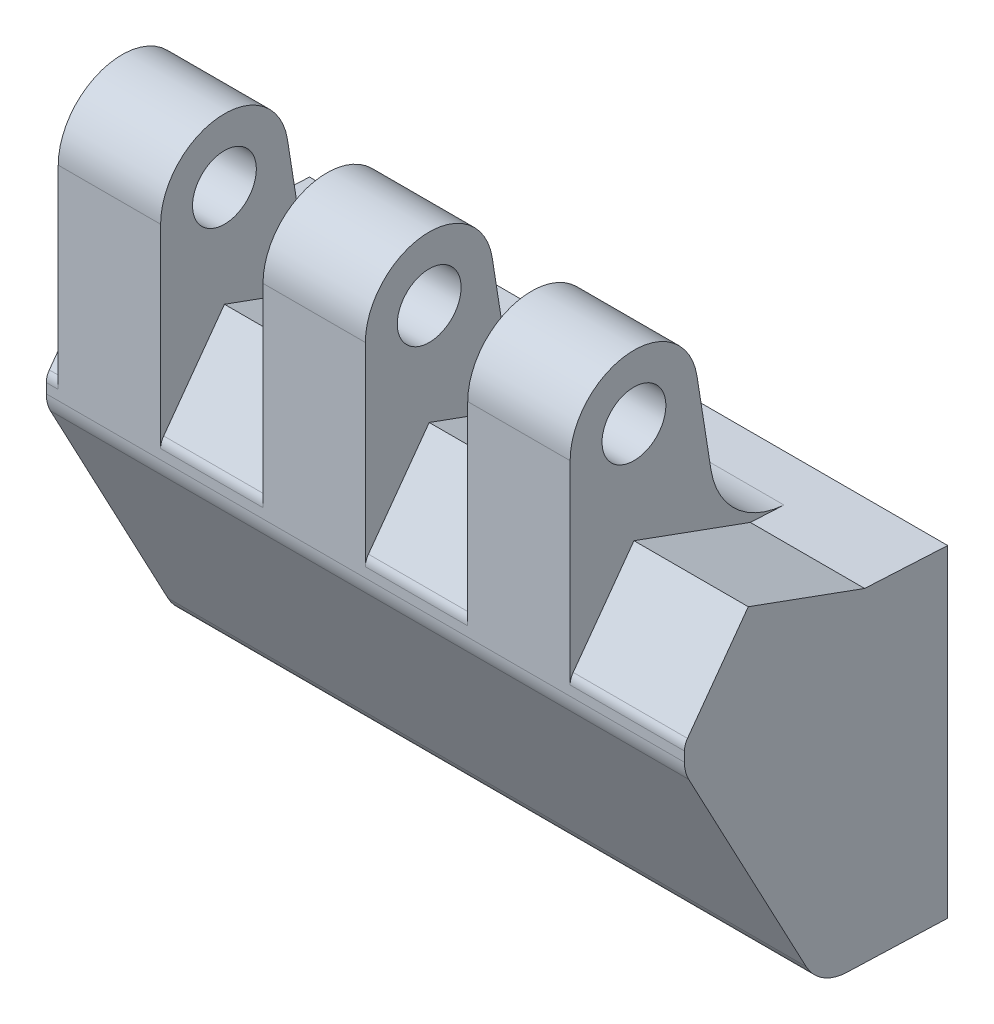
ISO-10303-21;
HEADER;
FILE_DESCRIPTION(('STEP AP214'),'2;1');
FILE_NAME('part.step','',(''),(''),'','','');
FILE_SCHEMA(('AUTOMOTIVE_DESIGN { 1 0 10303 214 1 1 1 1 }'));
ENDSEC;
DATA;
#1=APPLICATION_CONTEXT('core data for automotive mechanical design processes');
#2=APPLICATION_PROTOCOL_DEFINITION('international standard','automotive_design',2000,#1);
#3=PRODUCT_CONTEXT('',#1,'mechanical');
#4=PRODUCT('Part','Part','',(#3));
#5=PRODUCT_RELATED_PRODUCT_CATEGORY('part','',(#4));
#6=PRODUCT_DEFINITION_FORMATION('','',#4);
#7=PRODUCT_DEFINITION_CONTEXT('part definition',#1,'design');
#8=PRODUCT_DEFINITION('design','',#6,#7);
#9=PRODUCT_DEFINITION_SHAPE('','',#8);
#10=(LENGTH_UNIT() NAMED_UNIT(*) SI_UNIT(.MILLI.,.METRE.));
#11=(NAMED_UNIT(*) PLANE_ANGLE_UNIT() SI_UNIT($,.RADIAN.));
#12=(NAMED_UNIT(*) SI_UNIT($,.STERADIAN.) SOLID_ANGLE_UNIT());
#13=UNCERTAINTY_MEASURE_WITH_UNIT(LENGTH_MEASURE(1.E-05),#10,'distance_accuracy_value','');
#14=(GEOMETRIC_REPRESENTATION_CONTEXT(3) GLOBAL_UNCERTAINTY_ASSIGNED_CONTEXT((#13)) GLOBAL_UNIT_ASSIGNED_CONTEXT((#10,
#11,#12)) REPRESENTATION_CONTEXT('',''));
#15=CARTESIAN_POINT('',(0.,0.,0.));
#16=DIRECTION('',(0.,0.,1.));
#17=DIRECTION('',(1.,0.,0.));
#18=AXIS2_PLACEMENT_3D('',#15,#16,#17);
#19=CARTESIAN_POINT('',(30.25,10.93,0.));
#20=DIRECTION('',(0.,0.998629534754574,-0.0523359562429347));
#21=DIRECTION('',(0.,0.0523359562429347,0.998629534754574));
#22=AXIS2_PLACEMENT_3D('',#19,#20,#21);
#23=PLANE('',#22);
#24=DIRECTION('',(-1.,0.,0.));
#25=VECTOR('',#24,1.);
#26=CARTESIAN_POINT('',(30.25,10.93,0.));
#27=LINE('',#26,#25);
#28=CARTESIAN_POINT('',(30.,10.93,0.));
#29=VERTEX_POINT('',#28);
#30=CARTESIAN_POINT('',(-10.,10.93,0.));
#31=VERTEX_POINT('',#30);
#32=EDGE_CURVE('E258',#29,#31,#27,.T.);
#33=ORIENTED_EDGE('',*,*,#32,.T.);
#34=DIRECTION('',(0.,-0.0523359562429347,-0.998629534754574));
#35=VECTOR('',#34,1.);
#36=CARTESIAN_POINT('',(-10.,11.2029078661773,5.2073922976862));
#37=LINE('',#36,#35);
#38=CARTESIAN_POINT('',(-10.,11.2029078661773,5.2073922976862));
#39=VERTEX_POINT('',#38);
#40=EDGE_CURVE('E239',#39,#31,#37,.T.);
#41=ORIENTED_EDGE('',*,*,#40,.F.);
#42=DIRECTION('',(-1.,0.,0.));
#43=VECTOR('',#42,1.);
#44=CARTESIAN_POINT('',(30.25,11.2029078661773,5.2073922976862));
#45=LINE('',#44,#43);
#46=CARTESIAN_POINT('',(-9.2499999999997,11.2029078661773,5.2073922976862));
#47=VERTEX_POINT('',#46);
#48=EDGE_CURVE('E387',#47,#39,#45,.T.);
#49=ORIENTED_EDGE('',*,*,#48,.F.);
#50=DIRECTION('',(0.,0.0523359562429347,0.998629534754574));
#51=VECTOR('',#50,1.);
#52=CARTESIAN_POINT('',(-9.2499999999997,10.93,0.));
#53=LINE('',#52,#51);
#54=CARTESIAN_POINT('',(-9.2499999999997,11.0922838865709,3.09656102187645));
#55=VERTEX_POINT('',#54);
#56=EDGE_CURVE('E425',#55,#47,#53,.T.);
#57=ORIENTED_EDGE('',*,*,#56,.F.);
#58=DIRECTION('',(1.,0.,0.));
#59=VECTOR('',#58,1.);
#60=CARTESIAN_POINT('',(-9.2499999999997,11.0922838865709,3.09656102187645));
#61=LINE('',#60,#59);
#62=CARTESIAN_POINT('',(-2.833333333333,11.0922838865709,3.09656102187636));
#63=VERTEX_POINT('',#62);
#64=EDGE_CURVE('E9',#63,#55,#61,.F.);
#65=ORIENTED_EDGE('',*,*,#64,.F.);
#66=DIRECTION('',(0.,0.0523359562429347,0.998629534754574));
#67=VECTOR('',#66,1.);
#68=CARTESIAN_POINT('',(-2.833333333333,10.93,0.));
#69=LINE('',#68,#67);
#70=CARTESIAN_POINT('',(-2.833333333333,11.2029078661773,5.2073922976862));
#71=VERTEX_POINT('',#70);
#72=EDGE_CURVE('E407',#63,#71,#69,.T.);
#73=ORIENTED_EDGE('',*,*,#72,.T.);
#74=CARTESIAN_POINT('',(3.5833333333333,11.2029078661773,5.2073922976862));
#75=VERTEX_POINT('',#74);
#76=EDGE_CURVE('E391',#75,#71,#45,.T.);
#77=ORIENTED_EDGE('',*,*,#76,.F.);
#78=DIRECTION('',(0.,0.0523359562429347,0.998629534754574));
#79=VECTOR('',#78,1.);
#80=CARTESIAN_POINT('',(3.5833333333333,10.93,0.));
#81=LINE('',#80,#79);
#82=CARTESIAN_POINT('',(3.5833333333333,11.0922838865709,3.09656102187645));
#83=VERTEX_POINT('',#82);
#84=EDGE_CURVE('E362',#83,#75,#81,.T.);
#85=ORIENTED_EDGE('',*,*,#84,.F.);
#86=DIRECTION('',(1.,0.,0.));
#87=VECTOR('',#86,1.);
#88=CARTESIAN_POINT('',(3.5833333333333,11.0922838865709,3.09656102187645));
#89=LINE('',#88,#87);
#90=CARTESIAN_POINT('',(10.,11.0922838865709,3.09656102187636));
#91=VERTEX_POINT('',#90);
#92=EDGE_CURVE('E257',#91,#83,#89,.F.);
#93=ORIENTED_EDGE('',*,*,#92,.F.);
#94=DIRECTION('',(0.,0.0523359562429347,0.998629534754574));
#95=VECTOR('',#94,1.);
#96=CARTESIAN_POINT('',(10.,10.93,0.));
#97=LINE('',#96,#95);
#98=CARTESIAN_POINT('',(10.,11.2029078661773,5.2073922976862));
#99=VERTEX_POINT('',#98);
#100=EDGE_CURVE('E350',#91,#99,#97,.T.);
#101=ORIENTED_EDGE('',*,*,#100,.T.);
#102=CARTESIAN_POINT('',(16.4166666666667,11.2029078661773,5.2073922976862));
#103=VERTEX_POINT('',#102);
#104=EDGE_CURVE('E390',#103,#99,#45,.T.);
#105=ORIENTED_EDGE('',*,*,#104,.F.);
#106=DIRECTION('',(0.,0.0523359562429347,0.998629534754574));
#107=VECTOR('',#106,1.);
#108=CARTESIAN_POINT('',(16.4166666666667,10.93,0.));
#109=LINE('',#108,#107);
#110=CARTESIAN_POINT('',(16.4166666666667,11.0922838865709,3.09656102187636));
#111=VERTEX_POINT('',#110);
#112=EDGE_CURVE('E275',#111,#103,#109,.T.);
#113=ORIENTED_EDGE('',*,*,#112,.F.);
#114=DIRECTION('',(-1.,0.,0.));
#115=VECTOR('',#114,1.);
#116=CARTESIAN_POINT('',(22.8333333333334,11.0922838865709,3.09656102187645));
#117=LINE('',#116,#115);
#118=CARTESIAN_POINT('',(22.8333333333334,11.0922838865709,3.09656102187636));
#119=VERTEX_POINT('',#118);
#120=EDGE_CURVE('E22',#111,#119,#117,.F.);
#121=ORIENTED_EDGE('',*,*,#120,.T.);
#122=DIRECTION('',(0.,0.0523359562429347,0.998629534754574));
#123=VECTOR('',#122,1.);
#124=CARTESIAN_POINT('',(22.8333333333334,10.93,0.));
#125=LINE('',#124,#123);
#126=CARTESIAN_POINT('',(22.8333333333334,11.2029078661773,5.2073922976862));
#127=VERTEX_POINT('',#126);
#128=EDGE_CURVE('E272',#119,#127,#125,.T.);
#129=ORIENTED_EDGE('',*,*,#128,.T.);
#130=CARTESIAN_POINT('',(30.,11.2029078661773,5.2073922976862));
#131=VERTEX_POINT('',#130);
#132=EDGE_CURVE('E262',#131,#127,#45,.T.);
#133=ORIENTED_EDGE('',*,*,#132,.F.);
#134=DIRECTION('',(0.,0.0523359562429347,0.998629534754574));
#135=VECTOR('',#134,1.);
#136=CARTESIAN_POINT('',(30.,10.93,0.));
#137=LINE('',#136,#135);
#138=EDGE_CURVE('E481',#29,#131,#137,.T.);
#139=ORIENTED_EDGE('',*,*,#138,.F.);
#140=EDGE_LOOP('',(#33,#41,#49,#57,#65,#73,#77,#85,#93,#101,#105,#113,#121,#129,#133,#139));
#141=FACE_BOUND('',#140,.T.);
#142=ADVANCED_FACE('F14',(#141),#23,.T.);
#143=CARTESIAN_POINT('',(30.25,-9.07892726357,6.330694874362));
#144=DIRECTION('',(0.,-0.999390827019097,0.0348994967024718));
#145=DIRECTION('',(0.,-0.0348994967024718,-0.999390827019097));
#146=AXIS2_PLACEMENT_3D('',#143,#144,#145);
#147=PLANE('',#146);
#148=DIRECTION('',(-1.,0.,0.));
#149=VECTOR('',#148,1.);
#150=CARTESIAN_POINT('',(30.25,-9.07892726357,6.330694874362));
#151=LINE('',#150,#149);
#152=CARTESIAN_POINT('',(30.,-9.07892726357,6.330694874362));
#153=VERTEX_POINT('',#152);
#154=CARTESIAN_POINT('',(-10.,-9.07892726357,6.330694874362));
#155=VERTEX_POINT('',#154);
#156=EDGE_CURVE('E251',#153,#155,#151,.T.);
#157=ORIENTED_EDGE('',*,*,#156,.T.);
#158=DIRECTION('',(0.,0.0348994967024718,0.999390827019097));
#159=VECTOR('',#158,1.);
#160=CARTESIAN_POINT('',(-10.,-9.3,0.));
#161=LINE('',#160,#159);
#162=CARTESIAN_POINT('',(-10.,-9.3,0.));
#163=VERTEX_POINT('',#162);
#164=EDGE_CURVE('E236',#163,#155,#161,.T.);
#165=ORIENTED_EDGE('',*,*,#164,.F.);
#166=DIRECTION('',(-1.,0.,0.));
#167=VECTOR('',#166,1.);
#168=CARTESIAN_POINT('',(30.25,-9.3,0.));
#169=LINE('',#168,#167);
#170=CARTESIAN_POINT('',(30.,-9.3,0.));
#171=VERTEX_POINT('',#170);
#172=EDGE_CURVE('E249',#171,#163,#169,.T.);
#173=ORIENTED_EDGE('',*,*,#172,.F.);
#174=DIRECTION('',(0.,-0.0348994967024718,-0.999390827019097));
#175=VECTOR('',#174,1.);
#176=CARTESIAN_POINT('',(30.,-9.07892726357,6.330694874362));
#177=LINE('',#176,#175);
#178=EDGE_CURVE('E485',#153,#171,#177,.T.);
#179=ORIENTED_EDGE('',*,*,#178,.F.);
#180=EDGE_LOOP('',(#157,#165,#173,#179));
#181=FACE_BOUND('',#180,.T.);
#182=ADVANCED_FACE('F16',(#181),#147,.T.);
#183=CARTESIAN_POINT('',(30.25,-9.3,0.));
#184=DIRECTION('',(0.,0.,-1.));
#185=DIRECTION('',(1.,0.,0.));
#186=AXIS2_PLACEMENT_3D('',#183,#184,#185);
#187=PLANE('',#186);
#188=CARTESIAN_POINT('',(20.,0.,0.));
#189=DIRECTION('',(0.,0.,1.));
#190=DIRECTION('',(1.,0.,0.));
#191=AXIS2_PLACEMENT_3D('',#188,#189,#190);
#192=CIRCLE('',#191,2.);
#193=CARTESIAN_POINT('',(22.,0.,0.));
#194=VERTEX_POINT('',#193);
#195=EDGE_CURVE('E497',#194,#194,#192,.T.);
#196=ORIENTED_EDGE('',*,*,#195,.T.);
#197=EDGE_LOOP('',(#196));
#198=FACE_BOUND('',#197,.T.);
#199=CARTESIAN_POINT('',(0.,0.,0.));
#200=DIRECTION('',(0.,0.,1.));
#201=DIRECTION('',(1.,0.,0.));
#202=AXIS2_PLACEMENT_3D('',#199,#200,#201);
#203=CIRCLE('',#202,2.);
#204=CARTESIAN_POINT('',(2.,0.,0.));
#205=VERTEX_POINT('',#204);
#206=EDGE_CURVE('E501',#205,#205,#203,.T.);
#207=ORIENTED_EDGE('',*,*,#206,.T.);
#208=EDGE_LOOP('',(#207));
#209=FACE_BOUND('',#208,.T.);
#210=ORIENTED_EDGE('',*,*,#172,.T.);
#211=DIRECTION('',(0.,-1.,0.));
#212=VECTOR('',#211,1.);
#213=CARTESIAN_POINT('',(-10.,10.93,0.));
#214=LINE('',#213,#212);
#215=EDGE_CURVE('E233',#31,#163,#214,.T.);
#216=ORIENTED_EDGE('',*,*,#215,.F.);
#217=ORIENTED_EDGE('',*,*,#32,.F.);
#218=DIRECTION('',(0.,1.,0.));
#219=VECTOR('',#218,1.);
#220=CARTESIAN_POINT('',(30.,-9.3,0.));
#221=LINE('',#220,#219);
#222=EDGE_CURVE('E256',#171,#29,#221,.T.);
#223=ORIENTED_EDGE('',*,*,#222,.F.);
#224=EDGE_LOOP('',(#210,#216,#217,#223));
#225=FACE_BOUND('',#224,.T.);
#226=ADVANCED_FACE('F255',(#198,#209,#225),#187,.T.);
#227=CARTESIAN_POINT('',(30.25,8.026752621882,16.5));
#228=DIRECTION('',(0.,0.,1.));
#229=DIRECTION('',(-1.,0.,0.));
#230=AXIS2_PLACEMENT_3D('',#227,#228,#229);
#231=PLANE('',#230);
#232=DIRECTION('',(-1.,0.,0.));
#233=VECTOR('',#232,1.);
#234=CARTESIAN_POINT('',(30.25,8.026752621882,16.5));
#235=LINE('',#234,#233);
#236=CARTESIAN_POINT('',(-9.2499999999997,8.026752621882,16.5));
#237=VERTEX_POINT('',#236);
#238=CARTESIAN_POINT('',(-10.,8.026752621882,16.5));
#239=VERTEX_POINT('',#238);
#240=EDGE_CURVE('E375',#237,#239,#235,.T.);
#241=ORIENTED_EDGE('',*,*,#240,.T.);
#242=DIRECTION('',(0.,1.,0.));
#243=VECTOR('',#242,1.);
#244=CARTESIAN_POINT('',(-10.,7.41266032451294,16.5));
#245=LINE('',#244,#243);
#246=CARTESIAN_POINT('',(-10.,7.41266032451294,16.5));
#247=VERTEX_POINT('',#246);
#248=EDGE_CURVE('E29',#247,#239,#245,.T.);
#249=ORIENTED_EDGE('',*,*,#248,.F.);
#250=DIRECTION('',(-1.,0.,0.));
#251=VECTOR('',#250,1.);
#252=CARTESIAN_POINT('',(30.25,7.412660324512,16.5));
#253=LINE('',#252,#251);
#254=CARTESIAN_POINT('',(30.,7.412660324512,16.5));
#255=VERTEX_POINT('',#254);
#256=EDGE_CURVE('E372',#255,#247,#253,.T.);
#257=ORIENTED_EDGE('',*,*,#256,.F.);
#258=DIRECTION('',(0.,-1.,0.));
#259=VECTOR('',#258,1.);
#260=CARTESIAN_POINT('',(30.,8.026752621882,16.5));
#261=LINE('',#260,#259);
#262=CARTESIAN_POINT('',(30.,8.026752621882,16.5));
#263=VERTEX_POINT('',#262);
#264=EDGE_CURVE('E492',#263,#255,#261,.T.);
#265=ORIENTED_EDGE('',*,*,#264,.F.);
#266=CARTESIAN_POINT('',(22.8333333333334,8.026752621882,16.5));
#267=VERTEX_POINT('',#266);
#268=EDGE_CURVE('E376',#263,#267,#235,.T.);
#269=ORIENTED_EDGE('',*,*,#268,.T.);
#270=DIRECTION('',(0.,-1.,0.));
#271=VECTOR('',#270,1.);
#272=CARTESIAN_POINT('',(22.8333333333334,20.2,16.5));
#273=LINE('',#272,#271);
#274=CARTESIAN_POINT('',(22.8333333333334,20.2,16.5));
#275=VERTEX_POINT('',#274);
#276=EDGE_CURVE('E288',#275,#267,#273,.T.);
#277=ORIENTED_EDGE('',*,*,#276,.F.);
#278=DIRECTION('',(-1.,0.,0.));
#279=VECTOR('',#278,1.);
#280=CARTESIAN_POINT('',(22.8333333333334,20.2,16.5));
#281=LINE('',#280,#279);
#282=CARTESIAN_POINT('',(16.4166666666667,20.2,16.5));
#283=VERTEX_POINT('',#282);
#284=EDGE_CURVE('E452',#275,#283,#281,.T.);
#285=ORIENTED_EDGE('',*,*,#284,.T.);
#286=DIRECTION('',(0.,-1.,0.));
#287=VECTOR('',#286,1.);
#288=CARTESIAN_POINT('',(16.4166666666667,20.2,16.5));
#289=LINE('',#288,#287);
#290=CARTESIAN_POINT('',(16.4166666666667,8.026752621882,16.5));
#291=VERTEX_POINT('',#290);
#292=EDGE_CURVE('E428',#283,#291,#289,.T.);
#293=ORIENTED_EDGE('',*,*,#292,.T.);
#294=CARTESIAN_POINT('',(10.,8.026752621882,16.5));
#295=VERTEX_POINT('',#294);
#296=EDGE_CURVE('E379',#291,#295,#235,.T.);
#297=ORIENTED_EDGE('',*,*,#296,.T.);
#298=DIRECTION('',(0.,-1.,0.));
#299=VECTOR('',#298,1.);
#300=CARTESIAN_POINT('',(10.,20.2,16.5));
#301=LINE('',#300,#299);
#302=CARTESIAN_POINT('',(10.,20.2,16.5));
#303=VERTEX_POINT('',#302);
#304=EDGE_CURVE('E296',#303,#295,#301,.T.);
#305=ORIENTED_EDGE('',*,*,#304,.F.);
#306=DIRECTION('',(1.,0.,0.));
#307=VECTOR('',#306,1.);
#308=CARTESIAN_POINT('',(3.5833333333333,20.2,16.5));
#309=LINE('',#308,#307);
#310=CARTESIAN_POINT('',(3.5833333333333,20.2,16.5));
#311=VERTEX_POINT('',#310);
#312=EDGE_CURVE('E332',#311,#303,#309,.T.);
#313=ORIENTED_EDGE('',*,*,#312,.F.);
#314=DIRECTION('',(0.,-1.,0.));
#315=VECTOR('',#314,1.);
#316=CARTESIAN_POINT('',(3.5833333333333,20.2,16.5));
#317=LINE('',#316,#315);
#318=CARTESIAN_POINT('',(3.5833333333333,8.026752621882,16.5));
#319=VERTEX_POINT('',#318);
#320=EDGE_CURVE('E319',#311,#319,#317,.T.);
#321=ORIENTED_EDGE('',*,*,#320,.T.);
#322=CARTESIAN_POINT('',(-2.833333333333,8.026752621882,16.5));
#323=VERTEX_POINT('',#322);
#324=EDGE_CURVE('E380',#319,#323,#235,.T.);
#325=ORIENTED_EDGE('',*,*,#324,.T.);
#326=DIRECTION('',(0.,-1.,0.));
#327=VECTOR('',#326,1.);
#328=CARTESIAN_POINT('',(-2.833333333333,20.2,16.5));
#329=LINE('',#328,#327);
#330=CARTESIAN_POINT('',(-2.833333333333,20.2,16.5));
#331=VERTEX_POINT('',#330);
#332=EDGE_CURVE('E507',#331,#323,#329,.T.);
#333=ORIENTED_EDGE('',*,*,#332,.F.);
#334=DIRECTION('',(1.,0.,0.));
#335=VECTOR('',#334,1.);
#336=CARTESIAN_POINT('',(-9.2499999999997,20.2,16.5));
#337=LINE('',#336,#335);
#338=CARTESIAN_POINT('',(-9.2499999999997,20.2,16.5));
#339=VERTEX_POINT('',#338);
#340=EDGE_CURVE('E539',#339,#331,#337,.T.);
#341=ORIENTED_EDGE('',*,*,#340,.F.);
#342=DIRECTION('',(0.,-1.,0.));
#343=VECTOR('',#342,1.);
#344=CARTESIAN_POINT('',(-9.2499999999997,20.2,16.5));
#345=LINE('',#344,#343);
#346=EDGE_CURVE('E526',#339,#237,#345,.T.);
#347=ORIENTED_EDGE('',*,*,#346,.T.);
#348=EDGE_LOOP('',(#241,#249,#257,#265,#269,#277,#285,#293,#297,#305,#313,#321,#325,#333,#341,#347));
#349=FACE_BOUND('',#348,.T.);
#350=ADVANCED_FACE('F601',(#349),#231,.T.);
#351=CARTESIAN_POINT('',(30.25,7.41266032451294,14.2499999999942));
#352=DIRECTION('',(-1.,0.,0.));
#353=DIRECTION('',(0.,1.,0.));
#354=AXIS2_PLACEMENT_3D('',#351,#352,#353);
#355=CYLINDRICAL_SURFACE('',#354,2.25000000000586);
#356=ORIENTED_EDGE('',*,*,#256,.T.);
#357=CARTESIAN_POINT('',(-10.,7.41266032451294,14.2499999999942));
#358=DIRECTION('',(-1.,0.,0.));
#359=DIRECTION('',(0.,0.,1.));
#360=AXIS2_PLACEMENT_3D('',#357,#358,#359);
#361=CIRCLE('',#360,2.25000000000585);
#362=CARTESIAN_POINT('',(-10.,6.356349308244,16.236632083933));
#363=VERTEX_POINT('',#362);
#364=EDGE_CURVE('E593',#363,#247,#361,.T.);
#365=ORIENTED_EDGE('',*,*,#364,.F.);
#366=DIRECTION('',(-1.,0.,0.));
#367=VECTOR('',#366,1.);
#368=CARTESIAN_POINT('',(30.25,6.356349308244,16.236632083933));
#369=LINE('',#368,#367);
#370=CARTESIAN_POINT('',(30.,6.356349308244,16.236632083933));
#371=VERTEX_POINT('',#370);
#372=EDGE_CURVE('E369',#371,#363,#369,.T.);
#373=ORIENTED_EDGE('',*,*,#372,.F.);
#374=CARTESIAN_POINT('',(30.,7.41266032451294,14.2499999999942));
#375=DIRECTION('',(1.,0.,0.));
#376=DIRECTION('',(0.,0.,-1.));
#377=AXIS2_PLACEMENT_3D('',#374,#375,#376);
#378=CIRCLE('',#377,2.25000000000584);
#379=EDGE_CURVE('E494',#255,#371,#378,.T.);
#380=ORIENTED_EDGE('',*,*,#379,.F.);
#381=EDGE_LOOP('',(#356,#365,#373,#380));
#382=FACE_BOUND('',#381,.T.);
#383=ADVANCED_FACE('F604',(#382),#355,.T.);
#384=CARTESIAN_POINT('',(30.25,6.356349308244,16.236632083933));
#385=DIRECTION('',(0.,-0.469471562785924,0.882947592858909));
#386=DIRECTION('',(0.,-0.882947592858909,-0.469471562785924));
#387=AXIS2_PLACEMENT_3D('',#384,#385,#386);
#388=PLANE('',#387);
#389=ORIENTED_EDGE('',*,*,#372,.T.);
#390=DIRECTION('',(0.,0.882947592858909,0.469471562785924));
#391=VECTOR('',#390,1.);
#392=CARTESIAN_POINT('',(-10.,-7.48916947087,8.8748391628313));
#393=LINE('',#392,#391);
#394=CARTESIAN_POINT('',(-10.,-7.48916947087,8.87483916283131));
#395=VERTEX_POINT('',#394);
#396=EDGE_CURVE('E591',#395,#363,#393,.T.);
#397=ORIENTED_EDGE('',*,*,#396,.F.);
#398=DIRECTION('',(-1.,0.,0.));
#399=VECTOR('',#398,1.);
#400=CARTESIAN_POINT('',(30.25,-7.48916947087,8.8748391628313));
#401=LINE('',#400,#399);
#402=CARTESIAN_POINT('',(30.,-7.48916947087,8.8748391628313));
#403=VERTEX_POINT('',#402);
#404=EDGE_CURVE('E366',#403,#395,#401,.T.);
#405=ORIENTED_EDGE('',*,*,#404,.F.);
#406=DIRECTION('',(0.,-0.882947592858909,-0.469471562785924));
#407=VECTOR('',#406,1.);
#408=CARTESIAN_POINT('',(30.,6.356349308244,16.236632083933));
#409=LINE('',#408,#407);
#410=EDGE_CURVE('E37',#371,#403,#409,.T.);
#411=ORIENTED_EDGE('',*,*,#410,.F.);
#412=EDGE_LOOP('',(#389,#397,#405,#411));
#413=FACE_BOUND('',#412,.T.);
#414=ADVANCED_FACE('F606',(#413),#388,.T.);
#415=CARTESIAN_POINT('',(30.25,-6.08075478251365,6.2259963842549));
#416=DIRECTION('',(-1.,0.,0.));
#417=DIRECTION('',(0.,1.,0.));
#418=AXIS2_PLACEMENT_3D('',#415,#416,#417);
#419=CYLINDRICAL_SURFACE('',#418,2.99999999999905);
#420=ORIENTED_EDGE('',*,*,#404,.T.);
#421=CARTESIAN_POINT('',(-10.,-6.08075478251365,6.2259963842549));
#422=DIRECTION('',(-1.,0.,0.));
#423=DIRECTION('',(0.,0.,1.));
#424=AXIS2_PLACEMENT_3D('',#421,#422,#423);
#425=CIRCLE('',#424,2.99999999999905);
#426=EDGE_CURVE('E252',#155,#395,#425,.T.);
#427=ORIENTED_EDGE('',*,*,#426,.F.);
#428=ORIENTED_EDGE('',*,*,#156,.F.);
#429=CARTESIAN_POINT('',(30.,-6.08075478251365,6.2259963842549));
#430=DIRECTION('',(1.,0.,0.));
#431=DIRECTION('',(0.,0.,-1.));
#432=AXIS2_PLACEMENT_3D('',#429,#430,#431);
#433=CIRCLE('',#432,2.99999999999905);
#434=EDGE_CURVE('E585',#403,#153,#433,.T.);
#435=ORIENTED_EDGE('',*,*,#434,.F.);
#436=EDGE_LOOP('',(#420,#427,#428,#435));
#437=FACE_BOUND('',#436,.T.);
#438=ADVANCED_FACE('F588',(#437),#419,.T.);
#439=CARTESIAN_POINT('',(30.25,11.2029078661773,5.2073922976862));
#440=DIRECTION('',(0.,0.939692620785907,-0.342020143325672));
#441=DIRECTION('',(0.,0.342020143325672,0.939692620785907));
#442=AXIS2_PLACEMENT_3D('',#439,#440,#441);
#443=PLANE('',#442);
#444=ORIENTED_EDGE('',*,*,#48,.T.);
#445=DIRECTION('',(0.,-0.342020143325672,-0.939692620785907));
#446=VECTOR('',#445,1.);
#447=CARTESIAN_POINT('',(-10.,13.8572,12.5));
#448=LINE('',#447,#446);
#449=CARTESIAN_POINT('',(-10.,13.8572,12.5));
#450=VERTEX_POINT('',#449);
#451=EDGE_CURVE('E578',#450,#39,#448,.T.);
#452=ORIENTED_EDGE('',*,*,#451,.F.);
#453=DIRECTION('',(-1.,0.,0.));
#454=VECTOR('',#453,1.);
#455=CARTESIAN_POINT('',(30.25,13.8572,12.5));
#456=LINE('',#455,#454);
#457=CARTESIAN_POINT('',(-9.2499999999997,13.8572,12.5));
#458=VERTEX_POINT('',#457);
#459=EDGE_CURVE('E383',#458,#450,#456,.T.);
#460=ORIENTED_EDGE('',*,*,#459,.F.);
#461=DIRECTION('',(0.,0.342020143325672,0.939692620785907));
#462=VECTOR('',#461,1.);
#463=CARTESIAN_POINT('',(-9.2499999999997,11.2029078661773,5.2073922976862));
#464=LINE('',#463,#462);
#465=EDGE_CURVE('E422',#47,#458,#464,.T.);
#466=ORIENTED_EDGE('',*,*,#465,.F.);
#467=EDGE_LOOP('',(#444,#452,#460,#466));
#468=FACE_BOUND('',#467,.T.);
#469=ADVANCED_FACE('F615',(#468),#443,.T.);
#470=CARTESIAN_POINT('',(30.25,13.8572,12.5));
#471=DIRECTION('',(0.,0.587785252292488,0.809016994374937));
#472=DIRECTION('',(0.,-0.809016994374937,0.587785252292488));
#473=AXIS2_PLACEMENT_3D('',#470,#471,#472);
#474=PLANE('',#473);
#475=ORIENTED_EDGE('',*,*,#459,.T.);
#476=DIRECTION('',(0.,0.809016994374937,-0.587785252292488));
#477=VECTOR('',#476,1.);
#478=CARTESIAN_POINT('',(-10.,8.614537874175,16.309016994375));
#479=LINE('',#478,#477);
#480=CARTESIAN_POINT('',(-10.,8.614537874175,16.309016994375));
#481=VERTEX_POINT('',#480);
#482=EDGE_CURVE('E575',#481,#450,#479,.T.);
#483=ORIENTED_EDGE('',*,*,#482,.F.);
#484=DIRECTION('',(-1.,0.,0.));
#485=VECTOR('',#484,1.);
#486=CARTESIAN_POINT('',(30.25,8.614537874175,16.309016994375));
#487=LINE('',#486,#485);
#488=CARTESIAN_POINT('',(-9.2499999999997,8.614537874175,16.309016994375));
#489=VERTEX_POINT('',#488);
#490=EDGE_CURVE('E378',#489,#481,#487,.T.);
#491=ORIENTED_EDGE('',*,*,#490,.F.);
#492=DIRECTION('',(0.,-0.809016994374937,0.587785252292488));
#493=VECTOR('',#492,1.);
#494=CARTESIAN_POINT('',(-9.2499999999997,13.8572,12.5));
#495=LINE('',#494,#493);
#496=EDGE_CURVE('E414',#458,#489,#495,.T.);
#497=ORIENTED_EDGE('',*,*,#496,.F.);
#498=EDGE_LOOP('',(#475,#483,#491,#497));
#499=FACE_BOUND('',#498,.T.);
#500=ADVANCED_FACE('F574',(#499),#474,.T.);
#501=CARTESIAN_POINT('',(30.25,8.02675262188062,15.4999999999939));
#502=DIRECTION('',(-1.,0.,0.));
#503=DIRECTION('',(0.,1.,0.));
#504=AXIS2_PLACEMENT_3D('',#501,#502,#503);
#505=CYLINDRICAL_SURFACE('',#504,1.00000000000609);
#506=ORIENTED_EDGE('',*,*,#490,.T.);
#507=CARTESIAN_POINT('',(-10.,8.02675262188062,15.4999999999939));
#508=DIRECTION('',(-1.,0.,0.));
#509=DIRECTION('',(0.,0.,1.));
#510=AXIS2_PLACEMENT_3D('',#507,#508,#509);
#511=CIRCLE('',#510,1.0000000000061);
#512=EDGE_CURVE('E569',#239,#481,#511,.T.);
#513=ORIENTED_EDGE('',*,*,#512,.F.);
#514=ORIENTED_EDGE('',*,*,#240,.F.);
#515=CARTESIAN_POINT('',(-9.2499999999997,8.02675262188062,15.4999999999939));
#516=DIRECTION('',(-1.,0.,0.));
#517=DIRECTION('',(0.,-1.,0.));
#518=AXIS2_PLACEMENT_3D('',#515,#516,#517);
#519=CIRCLE('',#518,1.00000000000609);
#520=EDGE_CURVE('E411',#489,#237,#519,.F.);
#521=ORIENTED_EDGE('',*,*,#520,.F.);
#522=EDGE_LOOP('',(#506,#513,#514,#521));
#523=FACE_BOUND('',#522,.T.);
#524=ADVANCED_FACE('F567',(#523),#505,.T.);
#525=CARTESIAN_POINT('',(30.,13.8572,12.5));
#526=VERTEX_POINT('',#525);
#527=CARTESIAN_POINT('',(22.8333333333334,13.8572,12.5));
#528=VERTEX_POINT('',#527);
#529=EDGE_CURVE('E386',#526,#528,#456,.T.);
#530=ORIENTED_EDGE('',*,*,#529,.F.);
#531=DIRECTION('',(0.,0.342020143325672,0.939692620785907));
#532=VECTOR('',#531,1.);
#533=CARTESIAN_POINT('',(30.,11.2029078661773,5.2073922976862));
#534=LINE('',#533,#532);
#535=EDGE_CURVE('E479',#131,#526,#534,.T.);
#536=ORIENTED_EDGE('',*,*,#535,.F.);
#537=ORIENTED_EDGE('',*,*,#132,.T.);
#538=DIRECTION('',(0.,0.342020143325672,0.939692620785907));
#539=VECTOR('',#538,1.);
#540=CARTESIAN_POINT('',(22.8333333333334,11.2029078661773,5.2073922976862));
#541=LINE('',#540,#539);
#542=EDGE_CURVE('E295',#127,#528,#541,.T.);
#543=ORIENTED_EDGE('',*,*,#542,.T.);
#544=EDGE_LOOP('',(#530,#536,#537,#543));
#545=FACE_BOUND('',#544,.T.);
#546=ADVANCED_FACE('F478',(#545),#443,.T.);
#547=CARTESIAN_POINT('',(30.,8.614537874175,16.309016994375));
#548=VERTEX_POINT('',#547);
#549=CARTESIAN_POINT('',(22.8333333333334,8.614537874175,16.309016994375));
#550=VERTEX_POINT('',#549);
#551=EDGE_CURVE('E381',#548,#550,#487,.T.);
#552=ORIENTED_EDGE('',*,*,#551,.F.);
#553=DIRECTION('',(0.,-0.809016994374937,0.587785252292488));
#554=VECTOR('',#553,1.);
#555=CARTESIAN_POINT('',(30.,13.8572,12.5));
#556=LINE('',#555,#554);
#557=EDGE_CURVE('E480',#526,#548,#556,.T.);
#558=ORIENTED_EDGE('',*,*,#557,.F.);
#559=ORIENTED_EDGE('',*,*,#529,.T.);
#560=DIRECTION('',(0.,-0.809016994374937,0.587785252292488));
#561=VECTOR('',#560,1.);
#562=CARTESIAN_POINT('',(22.8333333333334,13.8572,12.5));
#563=LINE('',#562,#561);
#564=EDGE_CURVE('E301',#528,#550,#563,.T.);
#565=ORIENTED_EDGE('',*,*,#564,.T.);
#566=EDGE_LOOP('',(#552,#558,#559,#565));
#567=FACE_BOUND('',#566,.T.);
#568=ADVANCED_FACE('F474',(#567),#474,.T.);
#569=ORIENTED_EDGE('',*,*,#268,.F.);
#570=CARTESIAN_POINT('',(30.,8.02675262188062,15.4999999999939));
#571=DIRECTION('',(1.,0.,0.));
#572=DIRECTION('',(0.,0.,-1.));
#573=AXIS2_PLACEMENT_3D('',#570,#571,#572);
#574=CIRCLE('',#573,1.0000000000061);
#575=EDGE_CURVE('E490',#548,#263,#574,.T.);
#576=ORIENTED_EDGE('',*,*,#575,.F.);
#577=ORIENTED_EDGE('',*,*,#551,.T.);
#578=CARTESIAN_POINT('',(22.8333333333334,8.02675262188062,15.4999999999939));
#579=DIRECTION('',(-1.,0.,0.));
#580=DIRECTION('',(0.,-1.,0.));
#581=AXIS2_PLACEMENT_3D('',#578,#579,#580);
#582=CIRCLE('',#581,1.00000000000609);
#583=EDGE_CURVE('E469',#550,#267,#582,.F.);
#584=ORIENTED_EDGE('',*,*,#583,.T.);
#585=EDGE_LOOP('',(#569,#576,#577,#584));
#586=FACE_BOUND('',#585,.T.);
#587=ADVANCED_FACE('F726',(#586),#505,.T.);
#588=ORIENTED_EDGE('',*,*,#104,.T.);
#589=DIRECTION('',(0.,0.342020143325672,0.939692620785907));
#590=VECTOR('',#589,1.);
#591=CARTESIAN_POINT('',(10.,11.2029078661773,5.2073922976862));
#592=LINE('',#591,#590);
#593=CARTESIAN_POINT('',(10.,13.8572,12.5));
#594=VERTEX_POINT('',#593);
#595=EDGE_CURVE('E347',#99,#594,#592,.T.);
#596=ORIENTED_EDGE('',*,*,#595,.T.);
#597=CARTESIAN_POINT('',(16.4166666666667,13.8572,12.5));
#598=VERTEX_POINT('',#597);
#599=EDGE_CURVE('E388',#598,#594,#456,.T.);
#600=ORIENTED_EDGE('',*,*,#599,.F.);
#601=DIRECTION('',(0.,0.342020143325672,0.939692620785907));
#602=VECTOR('',#601,1.);
#603=CARTESIAN_POINT('',(16.4166666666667,11.2029078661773,5.2073922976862));
#604=LINE('',#603,#602);
#605=EDGE_CURVE('E465',#103,#598,#604,.T.);
#606=ORIENTED_EDGE('',*,*,#605,.F.);
#607=EDGE_LOOP('',(#588,#596,#600,#606));
#608=FACE_BOUND('',#607,.T.);
#609=ADVANCED_FACE('F736',(#608),#443,.T.);
#610=ORIENTED_EDGE('',*,*,#599,.T.);
#611=DIRECTION('',(0.,-0.809016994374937,0.587785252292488));
#612=VECTOR('',#611,1.);
#613=CARTESIAN_POINT('',(10.,13.8572,12.5));
#614=LINE('',#613,#612);
#615=CARTESIAN_POINT('',(10.,8.614537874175,16.309016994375));
#616=VERTEX_POINT('',#615);
#617=EDGE_CURVE('E344',#594,#616,#614,.T.);
#618=ORIENTED_EDGE('',*,*,#617,.T.);
#619=CARTESIAN_POINT('',(16.4166666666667,8.614537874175,16.309016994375));
#620=VERTEX_POINT('',#619);
#621=EDGE_CURVE('E384',#620,#616,#487,.T.);
#622=ORIENTED_EDGE('',*,*,#621,.F.);
#623=DIRECTION('',(0.,-0.809016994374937,0.587785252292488));
#624=VECTOR('',#623,1.);
#625=CARTESIAN_POINT('',(16.4166666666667,13.8572,12.5));
#626=LINE('',#625,#624);
#627=EDGE_CURVE('E462',#598,#620,#626,.T.);
#628=ORIENTED_EDGE('',*,*,#627,.F.);
#629=EDGE_LOOP('',(#610,#618,#622,#628));
#630=FACE_BOUND('',#629,.T.);
#631=ADVANCED_FACE('F753',(#630),#474,.T.);
#632=ORIENTED_EDGE('',*,*,#621,.T.);
#633=CARTESIAN_POINT('',(10.,8.02675262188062,15.4999999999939));
#634=DIRECTION('',(-1.,0.,0.));
#635=DIRECTION('',(0.,-1.,0.));
#636=AXIS2_PLACEMENT_3D('',#633,#634,#635);
#637=CIRCLE('',#636,1.00000000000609);
#638=EDGE_CURVE('E341',#616,#295,#637,.F.);
#639=ORIENTED_EDGE('',*,*,#638,.T.);
#640=ORIENTED_EDGE('',*,*,#296,.F.);
#641=CARTESIAN_POINT('',(16.4166666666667,8.02675262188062,15.4999999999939));
#642=DIRECTION('',(-1.,0.,0.));
#643=DIRECTION('',(0.,-1.,0.));
#644=AXIS2_PLACEMENT_3D('',#641,#642,#643);
#645=CIRCLE('',#644,1.00000000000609);
#646=EDGE_CURVE('E459',#620,#291,#645,.F.);
#647=ORIENTED_EDGE('',*,*,#646,.F.);
#648=EDGE_LOOP('',(#632,#639,#640,#647));
#649=FACE_BOUND('',#648,.T.);
#650=ADVANCED_FACE('F727',(#649),#505,.T.);
#651=DIRECTION('',(0.,0.342020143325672,0.939692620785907));
#652=VECTOR('',#651,1.);
#653=CARTESIAN_POINT('',(-2.833333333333,11.2029078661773,5.2073922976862));
#654=LINE('',#653,#652);
#655=CARTESIAN_POINT('',(-2.833333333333,13.8572,12.5));
#656=VERTEX_POINT('',#655);
#657=EDGE_CURVE('E403',#71,#656,#654,.T.);
#658=ORIENTED_EDGE('',*,*,#657,.T.);
#659=CARTESIAN_POINT('',(3.5833333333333,13.8572,12.5));
#660=VERTEX_POINT('',#659);
#661=EDGE_CURVE('E389',#660,#656,#456,.T.);
#662=ORIENTED_EDGE('',*,*,#661,.F.);
#663=DIRECTION('',(0.,0.342020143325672,0.939692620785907));
#664=VECTOR('',#663,1.);
#665=CARTESIAN_POINT('',(3.5833333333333,11.2029078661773,5.2073922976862));
#666=LINE('',#665,#664);
#667=EDGE_CURVE('E359',#75,#660,#666,.T.);
#668=ORIENTED_EDGE('',*,*,#667,.F.);
#669=ORIENTED_EDGE('',*,*,#76,.T.);
#670=EDGE_LOOP('',(#658,#662,#668,#669));
#671=FACE_BOUND('',#670,.T.);
#672=ADVANCED_FACE('F401',(#671),#443,.T.);
#673=DIRECTION('',(0.,-0.809016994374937,0.587785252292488));
#674=VECTOR('',#673,1.);
#675=CARTESIAN_POINT('',(-2.833333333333,13.8572,12.5));
#676=LINE('',#675,#674);
#677=CARTESIAN_POINT('',(-2.833333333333,8.614537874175,16.309016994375));
#678=VERTEX_POINT('',#677);
#679=EDGE_CURVE('E416',#656,#678,#676,.T.);
#680=ORIENTED_EDGE('',*,*,#679,.T.);
#681=CARTESIAN_POINT('',(3.5833333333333,8.614537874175,16.309016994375));
#682=VERTEX_POINT('',#681);
#683=EDGE_CURVE('E385',#682,#678,#487,.T.);
#684=ORIENTED_EDGE('',*,*,#683,.F.);
#685=DIRECTION('',(0.,-0.809016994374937,0.587785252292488));
#686=VECTOR('',#685,1.);
#687=CARTESIAN_POINT('',(3.5833333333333,13.8572,12.5));
#688=LINE('',#687,#686);
#689=EDGE_CURVE('E356',#660,#682,#688,.T.);
#690=ORIENTED_EDGE('',*,*,#689,.F.);
#691=ORIENTED_EDGE('',*,*,#661,.T.);
#692=EDGE_LOOP('',(#680,#684,#690,#691));
#693=FACE_BOUND('',#692,.T.);
#694=ADVANCED_FACE('F554',(#693),#474,.T.);
#695=CARTESIAN_POINT('',(-2.833333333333,8.02675262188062,15.4999999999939));
#696=DIRECTION('',(-1.,0.,0.));
#697=DIRECTION('',(0.,-1.,0.));
#698=AXIS2_PLACEMENT_3D('',#695,#696,#697);
#699=CIRCLE('',#698,1.00000000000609);
#700=EDGE_CURVE('E548',#678,#323,#699,.F.);
#701=ORIENTED_EDGE('',*,*,#700,.T.);
#702=ORIENTED_EDGE('',*,*,#324,.F.);
#703=CARTESIAN_POINT('',(3.5833333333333,8.02675262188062,15.4999999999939));
#704=DIRECTION('',(-1.,0.,0.));
#705=DIRECTION('',(0.,-1.,0.));
#706=AXIS2_PLACEMENT_3D('',#703,#704,#705);
#707=CIRCLE('',#706,1.00000000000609);
#708=EDGE_CURVE('E353',#682,#319,#707,.F.);
#709=ORIENTED_EDGE('',*,*,#708,.F.);
#710=ORIENTED_EDGE('',*,*,#683,.T.);
#711=EDGE_LOOP('',(#701,#702,#709,#710));
#712=FACE_BOUND('',#711,.T.);
#713=ADVANCED_FACE('F562',(#712),#505,.T.);
#714=CARTESIAN_POINT('',(3.5833333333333,16.0792045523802,2.73514398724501));
#715=DIRECTION('',(1.,0.,0.));
#716=DIRECTION('',(0.,-1.,0.));
#717=AXIS2_PLACEMENT_3D('',#714,#715,#716);
#718=CYLINDRICAL_SURFACE('',#717,4.99999999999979);
#719=ORIENTED_EDGE('',*,*,#92,.T.);
#720=CARTESIAN_POINT('',(3.5833333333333,16.0792045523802,2.73514398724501));
#721=DIRECTION('',(-1.,0.,0.));
#722=DIRECTION('',(0.,1.,0.));
#723=AXIS2_PLACEMENT_3D('',#720,#721,#722);
#724=CIRCLE('',#723,4.99999999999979);
#725=CARTESIAN_POINT('',(3.5833333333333,15.2970322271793,7.6735856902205));
#726=VERTEX_POINT('',#725);
#727=EDGE_CURVE('E320',#83,#726,#724,.T.);
#728=ORIENTED_EDGE('',*,*,#727,.T.);
#729=DIRECTION('',(1.,0.,0.));
#730=VECTOR('',#729,1.);
#731=CARTESIAN_POINT('',(3.5833333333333,15.2970322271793,7.6735856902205));
#732=LINE('',#731,#730);
#733=CARTESIAN_POINT('',(10.,15.2970322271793,7.6735856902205));
#734=VERTEX_POINT('',#733);
#735=EDGE_CURVE('E338',#726,#734,#732,.T.);
#736=ORIENTED_EDGE('',*,*,#735,.T.);
#737=CARTESIAN_POINT('',(10.,16.0792045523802,2.73514398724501));
#738=DIRECTION('',(-1.,0.,0.));
#739=DIRECTION('',(0.,1.,0.));
#740=AXIS2_PLACEMENT_3D('',#737,#738,#739);
#741=CIRCLE('',#740,4.99999999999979);
#742=EDGE_CURVE('E299',#91,#734,#741,.T.);
#743=ORIENTED_EDGE('',*,*,#742,.F.);
#744=EDGE_LOOP('',(#719,#728,#736,#743));
#745=FACE_BOUND('',#744,.T.);
#746=ADVANCED_FACE('F717',(#745),#718,.F.);
#747=CARTESIAN_POINT('',(3.5833333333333,15.2970322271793,7.6735856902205));
#748=DIRECTION('',(0.,-0.15643446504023,0.987688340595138));
#749=DIRECTION('',(0.,-0.987688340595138,-0.15643446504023));
#750=AXIS2_PLACEMENT_3D('',#747,#748,#749);
#751=PLANE('',#750);
#752=DIRECTION('',(0.,0.987688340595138,0.15643446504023));
#753=VECTOR('',#752,1.);
#754=CARTESIAN_POINT('',(10.,15.2970322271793,7.6735856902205));
#755=LINE('',#754,#753);
#756=CARTESIAN_POINT('',(10.,20.8257378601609,8.5492466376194));
#757=VERTEX_POINT('',#756);
#758=EDGE_CURVE('E308',#734,#757,#755,.T.);
#759=ORIENTED_EDGE('',*,*,#758,.F.);
#760=ORIENTED_EDGE('',*,*,#735,.F.);
#761=DIRECTION('',(0.,0.987688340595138,0.15643446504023));
#762=VECTOR('',#761,1.);
#763=CARTESIAN_POINT('',(3.5833333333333,15.2970322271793,7.6735856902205));
#764=LINE('',#763,#762);
#765=CARTESIAN_POINT('',(3.5833333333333,20.8257378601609,8.5492466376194));
#766=VERTEX_POINT('',#765);
#767=EDGE_CURVE('E323',#726,#766,#764,.T.);
#768=ORIENTED_EDGE('',*,*,#767,.T.);
#769=DIRECTION('',(1.,0.,0.));
#770=VECTOR('',#769,1.);
#771=CARTESIAN_POINT('',(3.5833333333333,20.8257378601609,8.5492466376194));
#772=LINE('',#771,#770);
#773=EDGE_CURVE('E335',#766,#757,#772,.T.);
#774=ORIENTED_EDGE('',*,*,#773,.T.);
#775=EDGE_LOOP('',(#759,#760,#768,#774));
#776=FACE_BOUND('',#775,.T.);
#777=ADVANCED_FACE('F713',(#776),#751,.F.);
#778=CARTESIAN_POINT('',(3.5833333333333,20.2,12.5));
#779=DIRECTION('',(1.,0.,0.));
#780=DIRECTION('',(0.,-1.,0.));
#781=AXIS2_PLACEMENT_3D('',#778,#779,#780);
#782=CYLINDRICAL_SURFACE('',#781,4.);
#783=CARTESIAN_POINT('',(10.,20.2,12.5));
#784=DIRECTION('',(1.,0.,0.));
#785=DIRECTION('',(0.,-1.,0.));
#786=AXIS2_PLACEMENT_3D('',#783,#784,#785);
#787=CIRCLE('',#786,4.);
#788=EDGE_CURVE('E312',#757,#303,#787,.T.);
#789=ORIENTED_EDGE('',*,*,#788,.F.);
#790=ORIENTED_EDGE('',*,*,#773,.F.);
#791=CARTESIAN_POINT('',(3.5833333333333,20.2,12.5));
#792=DIRECTION('',(1.,0.,0.));
#793=DIRECTION('',(0.,-1.,0.));
#794=AXIS2_PLACEMENT_3D('',#791,#792,#793);
#795=CIRCLE('',#794,4.);
#796=EDGE_CURVE('E326',#766,#311,#795,.T.);
#797=ORIENTED_EDGE('',*,*,#796,.T.);
#798=ORIENTED_EDGE('',*,*,#312,.T.);
#799=EDGE_LOOP('',(#789,#790,#797,#798));
#800=FACE_BOUND('',#799,.T.);
#801=ADVANCED_FACE('F709',(#800),#782,.T.);
#802=CARTESIAN_POINT('',(3.5833333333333,20.2,12.5));
#803=DIRECTION('',(1.,0.,0.));
#804=DIRECTION('',(0.,-1.,0.));
#805=AXIS2_PLACEMENT_3D('',#802,#803,#804);
#806=CYLINDRICAL_SURFACE('',#805,2.);
#807=CARTESIAN_POINT('',(3.5833333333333,20.2,12.5));
#808=DIRECTION('',(1.,0.,0.));
#809=DIRECTION('',(0.,1.,0.));
#810=AXIS2_PLACEMENT_3D('',#807,#808,#809);
#811=CIRCLE('',#810,2.);
#812=CARTESIAN_POINT('',(3.5833333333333,22.2,12.5));
#813=VERTEX_POINT('',#812);
#814=EDGE_CURVE('E328',#813,#813,#811,.T.);
#815=ORIENTED_EDGE('',*,*,#814,.F.);
#816=EDGE_LOOP('',(#815));
#817=FACE_BOUND('',#816,.T.);
#818=CARTESIAN_POINT('',(10.,20.2,12.5));
#819=DIRECTION('',(1.,0.,0.));
#820=DIRECTION('',(0.,1.,0.));
#821=AXIS2_PLACEMENT_3D('',#818,#819,#820);
#822=CIRCLE('',#821,2.);
#823=CARTESIAN_POINT('',(10.,22.2,12.5));
#824=VERTEX_POINT('',#823);
#825=EDGE_CURVE('E314',#824,#824,#822,.T.);
#826=ORIENTED_EDGE('',*,*,#825,.T.);
#827=EDGE_LOOP('',(#826));
#828=FACE_BOUND('',#827,.T.);
#829=ADVANCED_FACE('F705',(#817,#828),#806,.F.);
#830=CARTESIAN_POINT('',(3.5833333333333,16.0792045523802,2.73514398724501));
#831=DIRECTION('',(1.,0.,0.));
#832=DIRECTION('',(0.,-1.,0.));
#833=AXIS2_PLACEMENT_3D('',#830,#831,#832);
#834=PLANE('',#833);
#835=ORIENTED_EDGE('',*,*,#84,.T.);
#836=ORIENTED_EDGE('',*,*,#667,.T.);
#837=ORIENTED_EDGE('',*,*,#689,.T.);
#838=ORIENTED_EDGE('',*,*,#708,.T.);
#839=ORIENTED_EDGE('',*,*,#320,.F.);
#840=ORIENTED_EDGE('',*,*,#796,.F.);
#841=ORIENTED_EDGE('',*,*,#767,.F.);
#842=ORIENTED_EDGE('',*,*,#727,.F.);
#843=EDGE_LOOP('',(#835,#836,#837,#838,#839,#840,#841,#842));
#844=FACE_BOUND('',#843,.T.);
#845=ORIENTED_EDGE('',*,*,#814,.T.);
#846=EDGE_LOOP('',(#845));
#847=FACE_BOUND('',#846,.T.);
#848=ADVANCED_FACE('F701',(#844,#847),#834,.F.);
#849=CARTESIAN_POINT('',(10.,16.0792045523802,2.73514398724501));
#850=DIRECTION('',(1.,0.,0.));
#851=DIRECTION('',(0.,-1.,0.));
#852=AXIS2_PLACEMENT_3D('',#849,#850,#851);
#853=PLANE('',#852);
#854=ORIENTED_EDGE('',*,*,#742,.T.);
#855=ORIENTED_EDGE('',*,*,#758,.T.);
#856=ORIENTED_EDGE('',*,*,#788,.T.);
#857=ORIENTED_EDGE('',*,*,#304,.T.);
#858=ORIENTED_EDGE('',*,*,#638,.F.);
#859=ORIENTED_EDGE('',*,*,#617,.F.);
#860=ORIENTED_EDGE('',*,*,#595,.F.);
#861=ORIENTED_EDGE('',*,*,#100,.F.);
#862=EDGE_LOOP('',(#854,#855,#856,#857,#858,#859,#860,#861));
#863=FACE_BOUND('',#862,.T.);
#864=ORIENTED_EDGE('',*,*,#825,.F.);
#865=EDGE_LOOP('',(#864));
#866=FACE_BOUND('',#865,.T.);
#867=ADVANCED_FACE('F698',(#863,#866),#853,.T.);
#868=CARTESIAN_POINT('',(22.8333333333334,16.0792045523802,2.73514398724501));
#869=DIRECTION('',(-1.,0.,0.));
#870=DIRECTION('',(0.,1.,0.));
#871=AXIS2_PLACEMENT_3D('',#868,#869,#870);
#872=CYLINDRICAL_SURFACE('',#871,4.99999999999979);
#873=CARTESIAN_POINT('',(16.4166666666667,16.0792045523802,2.73514398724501));
#874=DIRECTION('',(-1.,0.,0.));
#875=DIRECTION('',(0.,1.,0.));
#876=AXIS2_PLACEMENT_3D('',#873,#874,#875);
#877=CIRCLE('',#876,4.99999999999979);
#878=CARTESIAN_POINT('',(16.4166666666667,15.2970322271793,7.6735856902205));
#879=VERTEX_POINT('',#878);
#880=EDGE_CURVE('E280',#111,#879,#877,.T.);
#881=ORIENTED_EDGE('',*,*,#880,.T.);
#882=DIRECTION('',(-1.,0.,0.));
#883=VECTOR('',#882,1.);
#884=CARTESIAN_POINT('',(22.8333333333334,15.2970322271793,7.6735856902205));
#885=LINE('',#884,#883);
#886=CARTESIAN_POINT('',(22.8333333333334,15.2970322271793,7.6735856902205));
#887=VERTEX_POINT('',#886);
#888=EDGE_CURVE('E284',#887,#879,#885,.T.);
#889=ORIENTED_EDGE('',*,*,#888,.F.);
#890=CARTESIAN_POINT('',(22.8333333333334,16.0792045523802,2.73514398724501));
#891=DIRECTION('',(-1.,0.,0.));
#892=DIRECTION('',(0.,1.,0.));
#893=AXIS2_PLACEMENT_3D('',#890,#891,#892);
#894=CIRCLE('',#893,4.99999999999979);
#895=EDGE_CURVE('E282',#119,#887,#894,.T.);
#896=ORIENTED_EDGE('',*,*,#895,.F.);
#897=ORIENTED_EDGE('',*,*,#120,.F.);
#898=EDGE_LOOP('',(#881,#889,#896,#897));
#899=FACE_BOUND('',#898,.T.);
#900=ADVANCED_FACE('F278',(#899),#872,.F.);
#901=CARTESIAN_POINT('',(22.8333333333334,15.2970322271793,7.6735856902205));
#902=DIRECTION('',(0.,0.15643446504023,-0.987688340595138));
#903=DIRECTION('',(0.,0.987688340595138,0.15643446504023));
#904=AXIS2_PLACEMENT_3D('',#901,#902,#903);
#905=PLANE('',#904);
#906=DIRECTION('',(0.,0.987688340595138,0.15643446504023));
#907=VECTOR('',#906,1.);
#908=CARTESIAN_POINT('',(16.4166666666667,15.2970322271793,7.6735856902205));
#909=LINE('',#908,#907);
#910=CARTESIAN_POINT('',(16.4166666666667,20.8257378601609,8.5492466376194));
#911=VERTEX_POINT('',#910);
#912=EDGE_CURVE('E431',#879,#911,#909,.T.);
#913=ORIENTED_EDGE('',*,*,#912,.T.);
#914=DIRECTION('',(-1.,0.,0.));
#915=VECTOR('',#914,1.);
#916=CARTESIAN_POINT('',(22.8333333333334,20.8257378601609,8.5492466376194));
#917=LINE('',#916,#915);
#918=CARTESIAN_POINT('',(22.8333333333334,20.8257378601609,8.5492466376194));
#919=VERTEX_POINT('',#918);
#920=EDGE_CURVE('E455',#919,#911,#917,.T.);
#921=ORIENTED_EDGE('',*,*,#920,.F.);
#922=DIRECTION('',(0.,0.987688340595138,0.15643446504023));
#923=VECTOR('',#922,1.);
#924=CARTESIAN_POINT('',(22.8333333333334,15.2970322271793,7.6735856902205));
#925=LINE('',#924,#923);
#926=EDGE_CURVE('E287',#887,#919,#925,.T.);
#927=ORIENTED_EDGE('',*,*,#926,.F.);
#928=ORIENTED_EDGE('',*,*,#888,.T.);
#929=EDGE_LOOP('',(#913,#921,#927,#928));
#930=FACE_BOUND('',#929,.T.);
#931=ADVANCED_FACE('F691',(#930),#905,.T.);
#932=CARTESIAN_POINT('',(22.8333333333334,20.2,12.5));
#933=DIRECTION('',(-1.,0.,0.));
#934=DIRECTION('',(0.,1.,0.));
#935=AXIS2_PLACEMENT_3D('',#932,#933,#934);
#936=CYLINDRICAL_SURFACE('',#935,4.);
#937=CARTESIAN_POINT('',(16.4166666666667,20.2,12.5));
#938=DIRECTION('',(1.,0.,0.));
#939=DIRECTION('',(0.,-1.,0.));
#940=AXIS2_PLACEMENT_3D('',#937,#938,#939);
#941=CIRCLE('',#940,4.);
#942=EDGE_CURVE('E435',#911,#283,#941,.T.);
#943=ORIENTED_EDGE('',*,*,#942,.T.);
#944=ORIENTED_EDGE('',*,*,#284,.F.);
#945=CARTESIAN_POINT('',(22.8333333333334,20.2,12.5));
#946=DIRECTION('',(1.,0.,0.));
#947=DIRECTION('',(0.,-1.,0.));
#948=AXIS2_PLACEMENT_3D('',#945,#946,#947);
#949=CIRCLE('',#948,4.);
#950=EDGE_CURVE('E445',#919,#275,#949,.T.);
#951=ORIENTED_EDGE('',*,*,#950,.F.);
#952=ORIENTED_EDGE('',*,*,#920,.T.);
#953=EDGE_LOOP('',(#943,#944,#951,#952));
#954=FACE_BOUND('',#953,.T.);
#955=ADVANCED_FACE('F687',(#954),#936,.T.);
#956=CARTESIAN_POINT('',(22.8333333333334,20.2,12.5));
#957=DIRECTION('',(-1.,0.,0.));
#958=DIRECTION('',(0.,1.,0.));
#959=AXIS2_PLACEMENT_3D('',#956,#957,#958);
#960=CYLINDRICAL_SURFACE('',#959,2.);
#961=CARTESIAN_POINT('',(22.8333333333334,20.2,12.5));
#962=DIRECTION('',(1.,0.,0.));
#963=DIRECTION('',(0.,1.,0.));
#964=AXIS2_PLACEMENT_3D('',#961,#962,#963);
#965=CIRCLE('',#964,2.);
#966=CARTESIAN_POINT('',(22.8333333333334,22.2,12.5));
#967=VERTEX_POINT('',#966);
#968=EDGE_CURVE('E447',#967,#967,#965,.T.);
#969=ORIENTED_EDGE('',*,*,#968,.T.);
#970=EDGE_LOOP('',(#969));
#971=FACE_BOUND('',#970,.T.);
#972=CARTESIAN_POINT('',(16.4166666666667,20.2,12.5));
#973=DIRECTION('',(1.,0.,0.));
#974=DIRECTION('',(0.,1.,0.));
#975=AXIS2_PLACEMENT_3D('',#972,#973,#974);
#976=CIRCLE('',#975,2.);
#977=CARTESIAN_POINT('',(16.4166666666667,22.2,12.5));
#978=VERTEX_POINT('',#977);
#979=EDGE_CURVE('E438',#978,#978,#976,.T.);
#980=ORIENTED_EDGE('',*,*,#979,.F.);
#981=EDGE_LOOP('',(#980));
#982=FACE_BOUND('',#981,.T.);
#983=ADVANCED_FACE('F684',(#971,#982),#960,.F.);
#984=CARTESIAN_POINT('',(22.8333333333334,16.0792045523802,2.73514398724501));
#985=DIRECTION('',(1.,0.,0.));
#986=DIRECTION('',(0.,-1.,0.));
#987=AXIS2_PLACEMENT_3D('',#984,#985,#986);
#988=PLANE('',#987);
#989=ORIENTED_EDGE('',*,*,#895,.T.);
#990=ORIENTED_EDGE('',*,*,#926,.T.);
#991=ORIENTED_EDGE('',*,*,#950,.T.);
#992=ORIENTED_EDGE('',*,*,#276,.T.);
#993=ORIENTED_EDGE('',*,*,#583,.F.);
#994=ORIENTED_EDGE('',*,*,#564,.F.);
#995=ORIENTED_EDGE('',*,*,#542,.F.);
#996=ORIENTED_EDGE('',*,*,#128,.F.);
#997=EDGE_LOOP('',(#989,#990,#991,#992,#993,#994,#995,#996));
#998=FACE_BOUND('',#997,.T.);
#999=ORIENTED_EDGE('',*,*,#968,.F.);
#1000=EDGE_LOOP('',(#999));
#1001=FACE_BOUND('',#1000,.T.);
#1002=ADVANCED_FACE('F291',(#998,#1001),#988,.T.);
#1003=CARTESIAN_POINT('',(16.4166666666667,16.0792045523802,2.73514398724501));
#1004=DIRECTION('',(1.,0.,0.));
#1005=DIRECTION('',(0.,-1.,0.));
#1006=AXIS2_PLACEMENT_3D('',#1003,#1004,#1005);
#1007=PLANE('',#1006);
#1008=ORIENTED_EDGE('',*,*,#112,.T.);
#1009=ORIENTED_EDGE('',*,*,#605,.T.);
#1010=ORIENTED_EDGE('',*,*,#627,.T.);
#1011=ORIENTED_EDGE('',*,*,#646,.T.);
#1012=ORIENTED_EDGE('',*,*,#292,.F.);
#1013=ORIENTED_EDGE('',*,*,#942,.F.);
#1014=ORIENTED_EDGE('',*,*,#912,.F.);
#1015=ORIENTED_EDGE('',*,*,#880,.F.);
#1016=EDGE_LOOP('',(#1008,#1009,#1010,#1011,#1012,#1013,#1014,#1015));
#1017=FACE_BOUND('',#1016,.T.);
#1018=ORIENTED_EDGE('',*,*,#979,.T.);
#1019=EDGE_LOOP('',(#1018));
#1020=FACE_BOUND('',#1019,.T.);
#1021=ADVANCED_FACE('F677',(#1017,#1020),#1007,.F.);
#1022=CARTESIAN_POINT('',(-9.2499999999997,16.0792045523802,2.73514398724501));
#1023=DIRECTION('',(1.,0.,0.));
#1024=DIRECTION('',(0.,-1.,0.));
#1025=AXIS2_PLACEMENT_3D('',#1022,#1023,#1024);
#1026=CYLINDRICAL_SURFACE('',#1025,4.99999999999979);
#1027=ORIENTED_EDGE('',*,*,#64,.T.);
#1028=CARTESIAN_POINT('',(-9.2499999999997,16.0792045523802,2.73514398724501));
#1029=DIRECTION('',(-1.,0.,0.));
#1030=DIRECTION('',(0.,1.,0.));
#1031=AXIS2_PLACEMENT_3D('',#1028,#1029,#1030);
#1032=CIRCLE('',#1031,4.99999999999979);
#1033=CARTESIAN_POINT('',(-9.2499999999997,15.2970322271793,7.6735856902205));
#1034=VERTEX_POINT('',#1033);
#1035=EDGE_CURVE('E527',#55,#1034,#1032,.T.);
#1036=ORIENTED_EDGE('',*,*,#1035,.T.);
#1037=DIRECTION('',(1.,0.,0.));
#1038=VECTOR('',#1037,1.);
#1039=CARTESIAN_POINT('',(-9.2499999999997,15.2970322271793,7.6735856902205));
#1040=LINE('',#1039,#1038);
#1041=CARTESIAN_POINT('',(-2.833333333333,15.2970322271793,7.6735856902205));
#1042=VERTEX_POINT('',#1041);
#1043=EDGE_CURVE('E545',#1034,#1042,#1040,.T.);
#1044=ORIENTED_EDGE('',*,*,#1043,.T.);
#1045=CARTESIAN_POINT('',(-2.833333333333,16.0792045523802,2.73514398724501));
#1046=DIRECTION('',(-1.,0.,0.));
#1047=DIRECTION('',(0.,1.,0.));
#1048=AXIS2_PLACEMENT_3D('',#1045,#1046,#1047);
#1049=CIRCLE('',#1048,4.99999999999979);
#1050=EDGE_CURVE('E510',#63,#1042,#1049,.T.);
#1051=ORIENTED_EDGE('',*,*,#1050,.F.);
#1052=EDGE_LOOP('',(#1027,#1036,#1044,#1051));
#1053=FACE_BOUND('',#1052,.T.);
#1054=ADVANCED_FACE('F673',(#1053),#1026,.F.);
#1055=CARTESIAN_POINT('',(-9.2499999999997,15.2970322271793,7.6735856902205));
#1056=DIRECTION('',(0.,-0.15643446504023,0.987688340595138));
#1057=DIRECTION('',(0.,-0.987688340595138,-0.15643446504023));
#1058=AXIS2_PLACEMENT_3D('',#1055,#1056,#1057);
#1059=PLANE('',#1058);
#1060=DIRECTION('',(0.,0.987688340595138,0.15643446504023));
#1061=VECTOR('',#1060,1.);
#1062=CARTESIAN_POINT('',(-2.833333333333,15.2970322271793,7.6735856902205));
#1063=LINE('',#1062,#1061);
#1064=CARTESIAN_POINT('',(-2.833333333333,20.8257378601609,8.5492466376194));
#1065=VERTEX_POINT('',#1064);
#1066=EDGE_CURVE('E513',#1042,#1065,#1063,.T.);
#1067=ORIENTED_EDGE('',*,*,#1066,.F.);
#1068=ORIENTED_EDGE('',*,*,#1043,.F.);
#1069=DIRECTION('',(0.,0.987688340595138,0.15643446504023));
#1070=VECTOR('',#1069,1.);
#1071=CARTESIAN_POINT('',(-9.2499999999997,15.2970322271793,7.6735856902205));
#1072=LINE('',#1071,#1070);
#1073=CARTESIAN_POINT('',(-9.2499999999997,20.8257378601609,8.5492466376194));
#1074=VERTEX_POINT('',#1073);
#1075=EDGE_CURVE('E530',#1034,#1074,#1072,.T.);
#1076=ORIENTED_EDGE('',*,*,#1075,.T.);
#1077=DIRECTION('',(1.,0.,0.));
#1078=VECTOR('',#1077,1.);
#1079=CARTESIAN_POINT('',(-9.2499999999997,20.8257378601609,8.5492466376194));
#1080=LINE('',#1079,#1078);
#1081=EDGE_CURVE('E542',#1074,#1065,#1080,.T.);
#1082=ORIENTED_EDGE('',*,*,#1081,.T.);
#1083=EDGE_LOOP('',(#1067,#1068,#1076,#1082));
#1084=FACE_BOUND('',#1083,.T.);
#1085=ADVANCED_FACE('F669',(#1084),#1059,.F.);
#1086=CARTESIAN_POINT('',(-9.2499999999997,20.2,12.5));
#1087=DIRECTION('',(1.,0.,0.));
#1088=DIRECTION('',(0.,-1.,0.));
#1089=AXIS2_PLACEMENT_3D('',#1086,#1087,#1088);
#1090=CYLINDRICAL_SURFACE('',#1089,4.);
#1091=CARTESIAN_POINT('',(-2.833333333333,20.2,12.5));
#1092=DIRECTION('',(1.,0.,0.));
#1093=DIRECTION('',(0.,-1.,0.));
#1094=AXIS2_PLACEMENT_3D('',#1091,#1092,#1093);
#1095=CIRCLE('',#1094,4.);
#1096=EDGE_CURVE('E517',#1065,#331,#1095,.T.);
#1097=ORIENTED_EDGE('',*,*,#1096,.F.);
#1098=ORIENTED_EDGE('',*,*,#1081,.F.);
#1099=CARTESIAN_POINT('',(-9.2499999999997,20.2,12.5));
#1100=DIRECTION('',(1.,0.,0.));
#1101=DIRECTION('',(0.,-1.,0.));
#1102=AXIS2_PLACEMENT_3D('',#1099,#1100,#1101);
#1103=CIRCLE('',#1102,4.);
#1104=EDGE_CURVE('E533',#1074,#339,#1103,.T.);
#1105=ORIENTED_EDGE('',*,*,#1104,.T.);
#1106=ORIENTED_EDGE('',*,*,#340,.T.);
#1107=EDGE_LOOP('',(#1097,#1098,#1105,#1106));
#1108=FACE_BOUND('',#1107,.T.);
#1109=ADVANCED_FACE('F665',(#1108),#1090,.T.);
#1110=CARTESIAN_POINT('',(-9.2499999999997,20.2,12.5));
#1111=DIRECTION('',(1.,0.,0.));
#1112=DIRECTION('',(0.,-1.,0.));
#1113=AXIS2_PLACEMENT_3D('',#1110,#1111,#1112);
#1114=CYLINDRICAL_SURFACE('',#1113,2.);
#1115=CARTESIAN_POINT('',(-9.2499999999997,20.2,12.5));
#1116=DIRECTION('',(1.,0.,0.));
#1117=DIRECTION('',(0.,1.,0.));
#1118=AXIS2_PLACEMENT_3D('',#1115,#1116,#1117);
#1119=CIRCLE('',#1118,2.);
#1120=CARTESIAN_POINT('',(-9.2499999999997,22.2,12.5));
#1121=VERTEX_POINT('',#1120);
#1122=EDGE_CURVE('E535',#1121,#1121,#1119,.T.);
#1123=ORIENTED_EDGE('',*,*,#1122,.F.);
#1124=EDGE_LOOP('',(#1123));
#1125=FACE_BOUND('',#1124,.T.);
#1126=CARTESIAN_POINT('',(-2.833333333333,20.2,12.5));
#1127=DIRECTION('',(1.,0.,0.));
#1128=DIRECTION('',(0.,1.,0.));
#1129=AXIS2_PLACEMENT_3D('',#1126,#1127,#1128);
#1130=CIRCLE('',#1129,2.);
#1131=CARTESIAN_POINT('',(-2.833333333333,22.2,12.5));
#1132=VERTEX_POINT('',#1131);
#1133=EDGE_CURVE('E520',#1132,#1132,#1130,.T.);
#1134=ORIENTED_EDGE('',*,*,#1133,.T.);
#1135=EDGE_LOOP('',(#1134));
#1136=FACE_BOUND('',#1135,.T.);
#1137=ADVANCED_FACE('F661',(#1125,#1136),#1114,.F.);
#1138=CARTESIAN_POINT('',(-9.2499999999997,16.0792045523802,2.73514398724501));
#1139=DIRECTION('',(1.,0.,0.));
#1140=DIRECTION('',(0.,-1.,0.));
#1141=AXIS2_PLACEMENT_3D('',#1138,#1139,#1140);
#1142=PLANE('',#1141);
#1143=ORIENTED_EDGE('',*,*,#56,.T.);
#1144=ORIENTED_EDGE('',*,*,#465,.T.);
#1145=ORIENTED_EDGE('',*,*,#496,.T.);
#1146=ORIENTED_EDGE('',*,*,#520,.T.);
#1147=ORIENTED_EDGE('',*,*,#346,.F.);
#1148=ORIENTED_EDGE('',*,*,#1104,.F.);
#1149=ORIENTED_EDGE('',*,*,#1075,.F.);
#1150=ORIENTED_EDGE('',*,*,#1035,.F.);
#1151=EDGE_LOOP('',(#1143,#1144,#1145,#1146,#1147,#1148,#1149,#1150));
#1152=FACE_BOUND('',#1151,.T.);
#1153=ORIENTED_EDGE('',*,*,#1122,.T.);
#1154=EDGE_LOOP('',(#1153));
#1155=FACE_BOUND('',#1154,.T.);
#1156=ADVANCED_FACE('F650',(#1152,#1155),#1142,.F.);
#1157=CARTESIAN_POINT('',(-2.833333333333,16.0792045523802,2.73514398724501));
#1158=DIRECTION('',(1.,0.,0.));
#1159=DIRECTION('',(0.,-1.,0.));
#1160=AXIS2_PLACEMENT_3D('',#1157,#1158,#1159);
#1161=PLANE('',#1160);
#1162=ORIENTED_EDGE('',*,*,#1050,.T.);
#1163=ORIENTED_EDGE('',*,*,#1066,.T.);
#1164=ORIENTED_EDGE('',*,*,#1096,.T.);
#1165=ORIENTED_EDGE('',*,*,#332,.T.);
#1166=ORIENTED_EDGE('',*,*,#700,.F.);
#1167=ORIENTED_EDGE('',*,*,#679,.F.);
#1168=ORIENTED_EDGE('',*,*,#657,.F.);
#1169=ORIENTED_EDGE('',*,*,#72,.F.);
#1170=EDGE_LOOP('',(#1162,#1163,#1164,#1165,#1166,#1167,#1168,#1169));
#1171=FACE_BOUND('',#1170,.T.);
#1172=ORIENTED_EDGE('',*,*,#1133,.F.);
#1173=EDGE_LOOP('',(#1172));
#1174=FACE_BOUND('',#1173,.T.);
#1175=ADVANCED_FACE('F556',(#1171,#1174),#1161,.T.);
#1176=CARTESIAN_POINT('',(0.,0.,5.5));
#1177=DIRECTION('',(0.,0.,-1.));
#1178=DIRECTION('',(1.,0.,0.));
#1179=AXIS2_PLACEMENT_3D('',#1176,#1177,#1178);
#1180=CYLINDRICAL_SURFACE('',#1179,2.);
#1181=CARTESIAN_POINT('',(0.,0.,5.5));
#1182=DIRECTION('',(0.,0.,1.));
#1183=DIRECTION('',(1.,0.,0.));
#1184=AXIS2_PLACEMENT_3D('',#1181,#1182,#1183);
#1185=CIRCLE('',#1184,2.);
#1186=CARTESIAN_POINT('',(2.,0.,5.5));
#1187=VERTEX_POINT('',#1186);
#1188=EDGE_CURVE('E504',#1187,#1187,#1185,.T.);
#1189=ORIENTED_EDGE('',*,*,#1188,.T.);
#1190=EDGE_LOOP('',(#1189));
#1191=FACE_BOUND('',#1190,.T.);
#1192=ORIENTED_EDGE('',*,*,#206,.F.);
#1193=EDGE_LOOP('',(#1192));
#1194=FACE_BOUND('',#1193,.T.);
#1195=ADVANCED_FACE('F637',(#1191,#1194),#1180,.F.);
#1196=CARTESIAN_POINT('',(0.,0.,5.5));
#1197=DIRECTION('',(0.,0.,1.));
#1198=DIRECTION('',(0.,-1.,0.));
#1199=AXIS2_PLACEMENT_3D('',#1196,#1197,#1198);
#1200=PLANE('',#1199);
#1201=ORIENTED_EDGE('',*,*,#1188,.F.);
#1202=EDGE_LOOP('',(#1201));
#1203=FACE_BOUND('',#1202,.T.);
#1204=ADVANCED_FACE('F639',(#1203),#1200,.F.);
#1205=CARTESIAN_POINT('',(20.,0.,5.5));
#1206=DIRECTION('',(0.,0.,-1.));
#1207=DIRECTION('',(1.,0.,0.));
#1208=AXIS2_PLACEMENT_3D('',#1205,#1206,#1207);
#1209=CYLINDRICAL_SURFACE('',#1208,2.);
#1210=CARTESIAN_POINT('',(20.,0.,5.5));
#1211=DIRECTION('',(0.,0.,1.));
#1212=DIRECTION('',(1.,0.,0.));
#1213=AXIS2_PLACEMENT_3D('',#1210,#1211,#1212);
#1214=CIRCLE('',#1213,2.);
#1215=CARTESIAN_POINT('',(22.,0.,5.5));
#1216=VERTEX_POINT('',#1215);
#1217=EDGE_CURVE('E498',#1216,#1216,#1214,.T.);
#1218=ORIENTED_EDGE('',*,*,#1217,.T.);
#1219=EDGE_LOOP('',(#1218));
#1220=FACE_BOUND('',#1219,.T.);
#1221=ORIENTED_EDGE('',*,*,#195,.F.);
#1222=EDGE_LOOP('',(#1221));
#1223=FACE_BOUND('',#1222,.T.);
#1224=ADVANCED_FACE('F647',(#1220,#1223),#1209,.F.);
#1225=CARTESIAN_POINT('',(20.,0.,5.5));
#1226=DIRECTION('',(0.,0.,1.));
#1227=DIRECTION('',(0.,-1.,0.));
#1228=AXIS2_PLACEMENT_3D('',#1225,#1226,#1227);
#1229=PLANE('',#1228);
#1230=ORIENTED_EDGE('',*,*,#1217,.F.);
#1231=EDGE_LOOP('',(#1230));
#1232=FACE_BOUND('',#1231,.T.);
#1233=ADVANCED_FACE('F655',(#1232),#1229,.F.);
#1234=CARTESIAN_POINT('',(30.,-6.08075478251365,6.2259963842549));
#1235=DIRECTION('',(1.,0.,0.));
#1236=DIRECTION('',(0.,0.,-1.));
#1237=AXIS2_PLACEMENT_3D('',#1234,#1235,#1236);
#1238=PLANE('',#1237);
#1239=ORIENTED_EDGE('',*,*,#434,.T.);
#1240=ORIENTED_EDGE('',*,*,#178,.T.);
#1241=ORIENTED_EDGE('',*,*,#222,.T.);
#1242=ORIENTED_EDGE('',*,*,#138,.T.);
#1243=ORIENTED_EDGE('',*,*,#535,.T.);
#1244=ORIENTED_EDGE('',*,*,#557,.T.);
#1245=ORIENTED_EDGE('',*,*,#575,.T.);
#1246=ORIENTED_EDGE('',*,*,#264,.T.);
#1247=ORIENTED_EDGE('',*,*,#379,.T.);
#1248=ORIENTED_EDGE('',*,*,#410,.T.);
#1249=EDGE_LOOP('',(#1239,#1240,#1241,#1242,#1243,#1244,#1245,#1246,#1247,#1248));
#1250=FACE_BOUND('',#1249,.T.);
#1251=ADVANCED_FACE('F586',(#1250),#1238,.T.);
#1252=CARTESIAN_POINT('',(-10.,-6.08075478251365,6.2259963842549));
#1253=DIRECTION('',(-1.,0.,0.));
#1254=DIRECTION('',(0.,0.,1.));
#1255=AXIS2_PLACEMENT_3D('',#1252,#1253,#1254);
#1256=PLANE('',#1255);
#1257=ORIENTED_EDGE('',*,*,#215,.T.);
#1258=ORIENTED_EDGE('',*,*,#164,.T.);
#1259=ORIENTED_EDGE('',*,*,#426,.T.);
#1260=ORIENTED_EDGE('',*,*,#396,.T.);
#1261=ORIENTED_EDGE('',*,*,#364,.T.);
#1262=ORIENTED_EDGE('',*,*,#248,.T.);
#1263=ORIENTED_EDGE('',*,*,#512,.T.);
#1264=ORIENTED_EDGE('',*,*,#482,.T.);
#1265=ORIENTED_EDGE('',*,*,#451,.T.);
#1266=ORIENTED_EDGE('',*,*,#40,.T.);
#1267=EDGE_LOOP('',(#1257,#1258,#1259,#1260,#1261,#1262,#1263,#1264,#1265,#1266));
#1268=FACE_BOUND('',#1267,.T.);
#1269=ADVANCED_FACE('F235',(#1268),#1256,.T.);
#1270=CLOSED_SHELL('',(#142,#182,#226,#350,#383,#414,#438,#469,#500,#524,#546,#568,#587,#609,
#631,#650,#672,#694,#713,#746,#777,#801,#829,#848,#867,#900,#931,#955,#983,#1002,#1021,#1054,
#1085,#1109,#1137,#1156,#1175,#1195,#1204,#1224,#1233,#1251,#1269));
#1271=MANIFOLD_SOLID_BREP('B1',#1270);
#1272=ADVANCED_BREP_SHAPE_REPRESENTATION('',(#18,#1271),#14);
#1273=SHAPE_DEFINITION_REPRESENTATION(#9,#1272);
ENDSEC;
END-ISO-10303-21;
